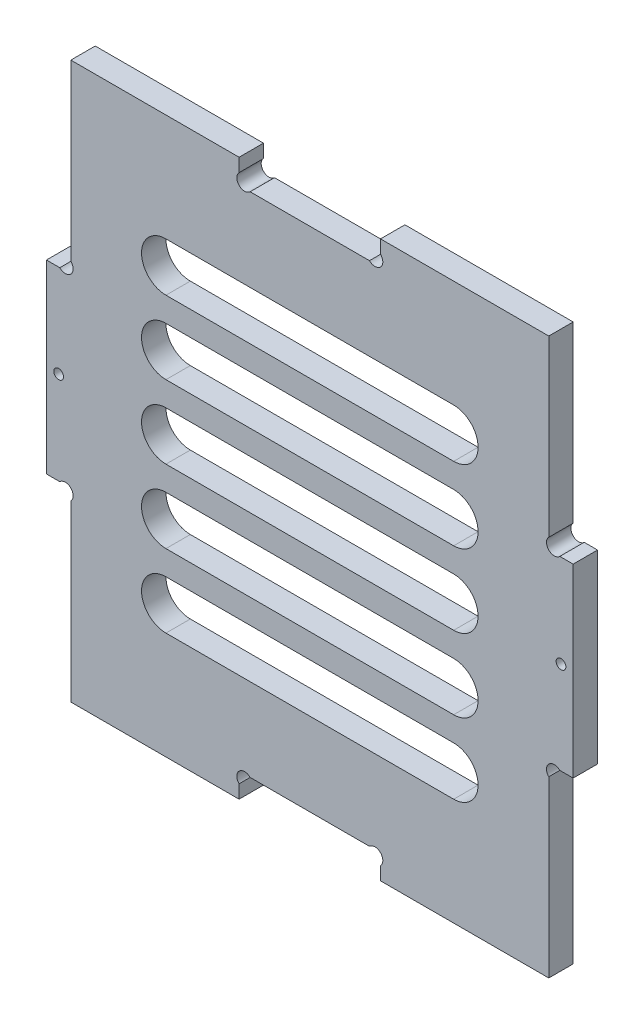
from build123d import *

# Parameters (mm, degrees)
ESQUISSE1_R        = 1
BOSS_EXTRU_1_DEPTH = 5


with BuildPart() as part:
    # Esquisse1 → Boss.-Extru.1 (new body)
    with BuildSketch(Plane.XY):
        with BuildLine():
            Line((36.246561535, -76.387603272), (36.246561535, -79.124861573))
            Line((36.246561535, -79.124861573), (70.746561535, -79.124861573))
            Line((70.746561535, -79.124861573), (70.746561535, -43.387603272))
            ThreePointArc((70.746561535, -43.387603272), (70.746561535, -41.124861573), (73.009303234, -41.124861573))
            Line((73.009303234, -41.124861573), (75.746561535, -41.124861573))
            Line((75.746561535, -41.124861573), (75.746561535, -3.124861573))
            Line((75.746561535, -3.124861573), (73.009303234, -3.124861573))
            ThreePointArc((73.009303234, -3.124861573), (70.746561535, -3.124861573), (70.746561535, -0.862119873))
            Line((70.746561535, -0.862119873), (70.746561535, 34.875138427))
            Line((70.746561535, 34.875138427), (36.246561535, 34.875138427))
            Line((36.246561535, 34.875138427), (36.246561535, 32.137880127))
            ThreePointArc((36.246561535, 32.137880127), (36.246561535, 29.875138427), (33.983819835, 29.875138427))
            Line((33.983819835, 29.875138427), (9.509303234, 29.875138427))
            ThreePointArc((9.509303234, 29.875138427), (7.246561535, 29.875138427), (7.246561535, 32.137880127))
            Line((7.246561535, 32.137880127), (7.246561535, 34.875138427))
            Line((7.246561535, 34.875138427), (-27.253438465, 34.875138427))
            Line((-27.253438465, 34.875138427), (-27.253438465, -0.862119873))
            ThreePointArc((-27.253438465, -0.862119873), (-27.253438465, -3.124861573), (-29.516180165, -3.124861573))
            Line((-29.516180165, -3.124861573), (-32.253438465, -3.124861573))
            Line((-32.253438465, -3.124861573), (-32.253438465, -41.124861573))
            Line((-32.253438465, -41.124861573), (-29.516180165, -41.124861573))
            ThreePointArc((-29.516180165, -41.124861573), (-27.253438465, -41.124861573), (-27.253438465, -43.387603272))
            Line((-27.253438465, -43.387603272), (-27.253438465, -79.124861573))
            Line((-27.253438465, -79.124861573), (7.246561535, -79.124861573))
            Line((7.246561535, -79.124861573), (7.246561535, -76.387603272))
            ThreePointArc((7.246561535, -76.387603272), (7.246561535, -74.124861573), (9.509303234, -74.124861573))
            Line((9.509303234, -74.124861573), (33.983819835, -74.124861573))
            ThreePointArc((33.983819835, -74.124861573), (36.246561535, -74.124861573), (36.246561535, -76.387603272))
        make_face()
        with Locations((73.246561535, -22.124861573)):
            Circle(ESQUISSE1_R, mode=Mode.SUBTRACT)
        with Locations(Location((-29.753438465, -22.124861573, 0), (0, 0, 180))):
            Circle(ESQUISSE1_R, mode=Mode.SUBTRACT)
        with BuildLine():
            Line((-7.753438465, -17.124861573), (51.246561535, -17.124861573))
            ThreePointArc((51.246561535, -17.124861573), (56.246561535, -22.124861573), (51.246561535, -27.124861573))
            Line((51.246561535, -27.124861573), (-7.753438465, -27.124861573))
            ThreePointArc((-7.753438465, -27.124861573), (-12.753438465, -22.124861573), (-7.753438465, -17.124861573))
        make_face(mode=Mode.SUBTRACT)
        with BuildLine():
            Line((-7.753438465, -2.124861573), (51.246561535, -2.124861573))
            ThreePointArc((51.246561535, -2.124861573), (56.246561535, -7.124861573), (51.246561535, -12.124861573))
            Line((51.246561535, -12.124861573), (-7.753438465, -12.124861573))
            ThreePointArc((-7.753438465, -12.124861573), (-12.753438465, -7.124861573), (-7.753438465, -2.124861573))
        make_face(mode=Mode.SUBTRACT)
        with BuildLine():
            Line((-7.753438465, 12.875138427), (51.246561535, 12.875138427))
            ThreePointArc((51.246561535, 12.875138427), (56.246561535, 7.875138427), (51.246561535, 2.875138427))
            Line((51.246561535, 2.875138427), (-7.753438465, 2.875138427))
            ThreePointArc((-7.753438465, 2.875138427), (-12.753438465, 7.875138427), (-7.753438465, 12.875138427))
        make_face(mode=Mode.SUBTRACT)
        with BuildLine():
            Line((-7.753438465, -32.124861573), (51.246561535, -32.124861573))
            ThreePointArc((51.246561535, -32.124861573), (56.246561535, -37.124861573), (51.246561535, -42.124861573))
            Line((51.246561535, -42.124861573), (-7.753438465, -42.124861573))
            ThreePointArc((-7.753438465, -42.124861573), (-12.753438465, -37.124861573), (-7.753438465, -32.124861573))
        make_face(mode=Mode.SUBTRACT)
        with BuildLine():
            Line((-7.753438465, -47.124861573), (51.246561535, -47.124861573))
            ThreePointArc((51.246561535, -47.124861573), (56.246561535, -52.124861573), (51.246561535, -57.124861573))
            Line((51.246561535, -57.124861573), (-7.753438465, -57.124861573))
            ThreePointArc((-7.753438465, -57.124861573), (-12.753438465, -52.124861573), (-7.753438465, -47.124861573))
        make_face(mode=Mode.SUBTRACT)
    extrude(amount=BOSS_EXTRU_1_DEPTH)


solid = part.part
